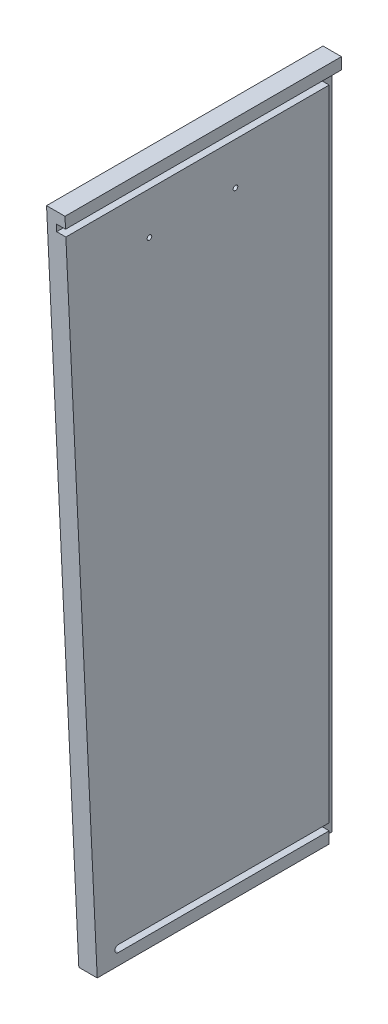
from build123d import *

# Parameters (mm, degrees)
BOSS_EXTRUDE1_DEPTH = 19.05
SKETCH2_W           = 9.525
SKETCH2_H           = 7.14375
CUT_EXTRUDE1_DEPTH  = 755.929278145
CUT_EXTRUDE2_DEPTH  = 9.525
SKETCH4_R           = 2.38125
CUT_EXTRUDE3_DEPTH  = 755.929278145
SKETCH5_W           = 50.8
SKETCH5_H           = 686.59375
CUT_EXTRUDE4_DEPTH  = 12.7


with BuildPart() as part:
    # Sketch1 → Boss-Extrude1 (new body)
    with BuildSketch(Plane(origin=(0, 0, 0), x_dir=(0, 0, -1), z_dir=(1, 0, 0))):
        Polygon((0, 0), (0, -698.5), (-252.4125, -698.5), (-285.75, 0), align=None)
    extrude(amount=BOSS_EXTRUDE1_DEPTH)

    # Sketch2 → Cut-Extrude1 (cut, through all)
    with BuildSketch(Plane(origin=(0, 0, 0), x_dir=(-1, 0, 0), z_dir=(0, 0, -1))):
        with Locations((-14.2875, -15.478125)):
            Rectangle(SKETCH2_W, SKETCH2_H)
    extrude(amount=-CUT_EXTRUDE1_DEPTH, mode=Mode.SUBTRACT)

    # Sketch3 → Cut-Extrude2 (cut)
    with BuildSketch(Plane(origin=(19.05, 0, 0), x_dir=(0, 0, -1), z_dir=(1, 0, 0))):
        with BuildLine():
            Line((0, -679.45), (-230.539925, -679.45))
            ThreePointArc((-230.539925, -679.45), (-234.1118, -683.021875), (-230.539925, -686.59375))
            Line((-230.539925, -686.59375), (0, -686.59375))
            Line((0, -686.59375), (0, -679.45))
        make_face()
    extrude(amount=-CUT_EXTRUDE2_DEPTH, mode=Mode.SUBTRACT)

    # Sketch4 → Cut-Extrude3 (cut, through all)
    with BuildSketch(Plane.ZY):
        with Locations((198.4375, -62.70625)):
            Circle(SKETCH4_R)
        with Locations((109.5375, -62.70625)):
            Circle(SKETCH4_R)
    extrude(amount=-CUT_EXTRUDE3_DEPTH, mode=Mode.SUBTRACT)

    # Sketch5 → Cut-Extrude4 (cut)
    with BuildSketch(Plane(origin=(0, 0, 0), x_dir=(-1, 0, 0), z_dir=(0, 0, -1))):
        with Locations((-34.925, -355.203125)):
            Rectangle(SKETCH5_W, SKETCH5_H)
    extrude(amount=-CUT_EXTRUDE4_DEPTH, mode=Mode.SUBTRACT)


solid = part.part
